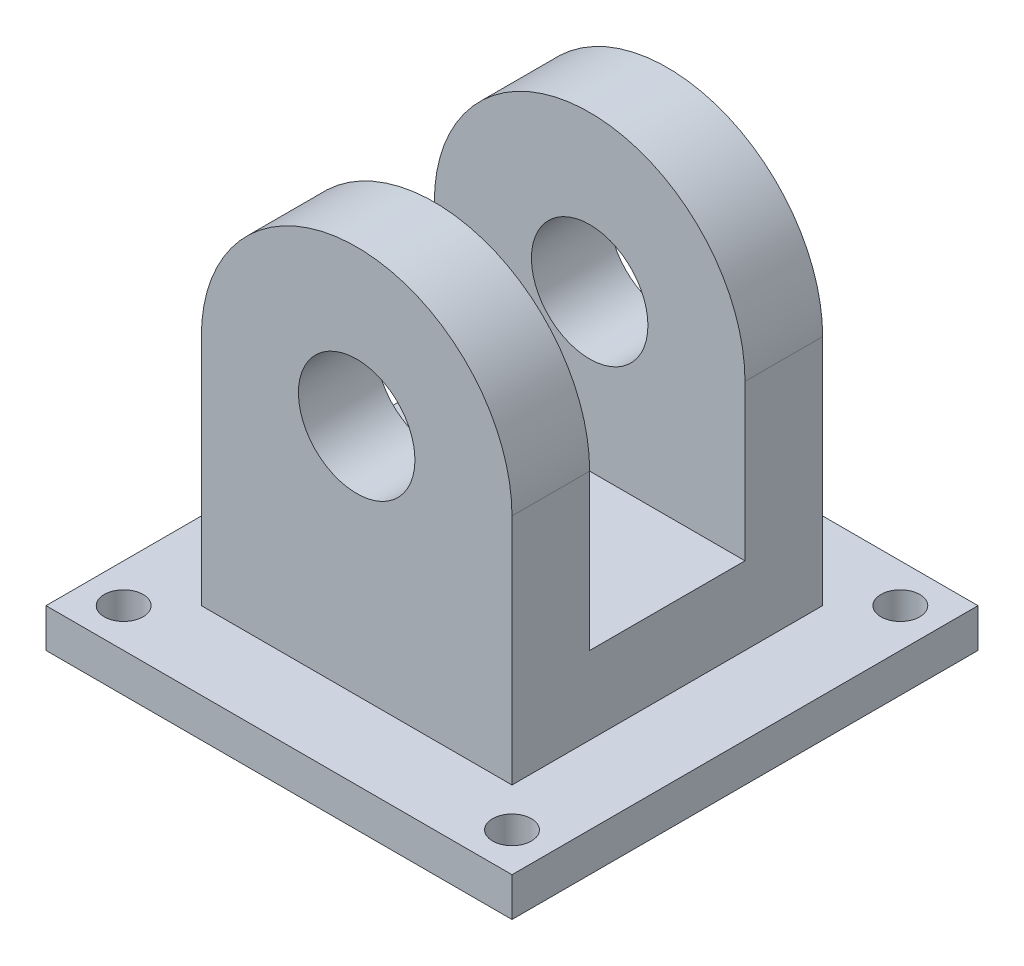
from build123d import *

# Parameters (mm, degrees)
BOSS_EXTRU_1_DEPTH           = 40
ESQUISSE2_W                  = 20
ESQUISSE2_H                  = 47.020533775
ENL_V_MAT_EXTRU_1_DEPTH      = 76.498344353
ENL_V_MAT_EXTRU_2_DEPTH      = 71.710678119
ENL_V_MAT_EXTRU_2_DEPTH_BACK = 71.710678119
ESQUISSE4_R                  = 7.5
ESQUISSE5_W                  = 60
ESQUISSE5_H                  = 60
BOSS_EXTRU_6_DEPTH           = 5
ESQUISSE6_R                  = 2.5
ENL_V_MAT_EXTRU_3_DEPTH      = 87.602540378


with BuildPart() as part:
    # Esquisse1 → Boss.-Extru.1 (new body)
    with BuildSketch(Plane.XY):
        with BuildLine():
            Line((0, 0), (-40, 0))
            Line((-40, 0), (-40, 30))
            ThreePointArc((-40, 30), (-20, 50), (0, 30))
            Line((0, 30), (0, 0))
        make_face()
    extrude(amount=BOSS_EXTRU_1_DEPTH)

    # Esquisse2 → Enl_v. mat.-Extru.1 (cut, through all)
    with BuildSketch(Plane(origin=(0, 0, 0), x_dir=(0, 0, -1), z_dir=(1, 0, 0))):
        with Locations((-20, 33.510266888)):
            Rectangle(ESQUISSE2_W, ESQUISSE2_H)
    extrude(amount=-ENL_V_MAT_EXTRU_1_DEPTH, mode=Mode.SUBTRACT)

    # Esquisse4 → Enl_v. mat.-Extru.2 (cut, two sides: drawn at the far end of the back side and taken through both)
    with BuildSketch(Plane(origin=(0, 0, 30), x_dir=(-1, 0, 0), z_dir=(0, 0, -1)).offset(-ENL_V_MAT_EXTRU_2_DEPTH_BACK)):
        with Locations(Location((20, 30, 0), (0, 0, 90))):
            Circle(ESQUISSE4_R)
    extrude(amount=ENL_V_MAT_EXTRU_2_DEPTH + ENL_V_MAT_EXTRU_2_DEPTH_BACK, mode=Mode.SUBTRACT)

    # Esquisse5 → Boss.-Extru.6 (add)
    with BuildSketch(Plane.XZ):
        with Locations((-20, 20)):
            Rectangle(ESQUISSE5_W, ESQUISSE5_H)
    extrude(amount=BOSS_EXTRU_6_DEPTH)

    # Esquisse6 → Enl_v. mat.-Extru.3 (cut, through all)
    with BuildSketch(Plane(origin=(0, 0, 0), x_dir=(1, 0, 0), z_dir=(0, 1, 0))):
        with Locations(Location((-45, 5, 0), (0, 0, 180))):
            Circle(ESQUISSE6_R)
        with Locations(Location((5, 5, 0), (0, 0, 180))):
            Circle(ESQUISSE6_R)
        with Locations(Location((5, -45, 0), (0, 0, 180))):
            Circle(ESQUISSE6_R)
        with Locations(Location((-45, -45, 0), (0, 0, 180))):
            Circle(ESQUISSE6_R)
    extrude(amount=-ENL_V_MAT_EXTRU_3_DEPTH, mode=Mode.SUBTRACT)


solid = part.part
